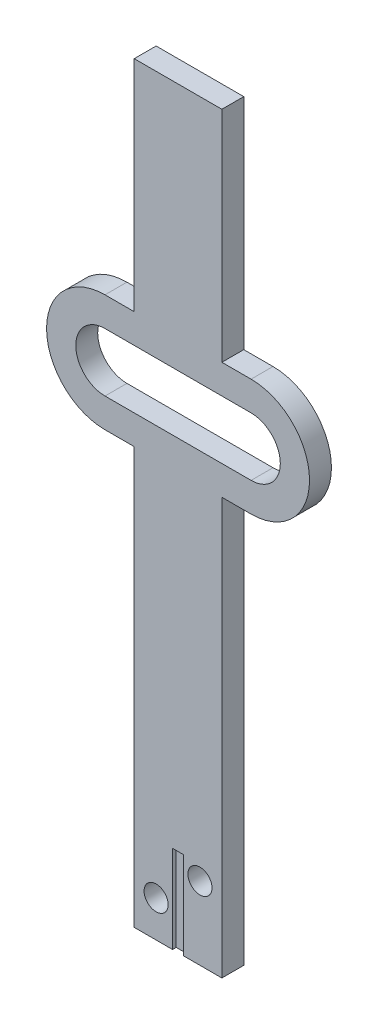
from build123d import *

# Parameters (mm, degrees)
BASE_EXTRUSION_DEPTH    = 3
ESQUISSE2_W             = 1.5
ESQUISSE2_H             = 12
ENL_V_MAT_EXTRU_1_DEPTH = 0.5
PER_AGE1_D              = 3.3
PER_AGE2_D              = 3.3


with BuildPart() as part:
    # Esquisse1 → Base-Extrusion (new body)
    with BuildSketch(Plane.XY):
        with BuildLine():
            Line((-10, 8), (-6, 8))
            Line((-6, 8), (-6, 38))
            Line((-6, 38), (6, 38))
            Line((6, 38), (6, 8))
            Line((6, 8), (10, 8))
            ThreePointArc((10, 8), (18, 0), (10, -8))
            Line((10, -8), (6, -8))
            Line((6, -8), (6, -65))
            Line((6, -65), (-6, -65))
            Line((-6, -65), (-6, -8))
            Line((-6, -8), (-10, -8))
            ThreePointArc((-10, -8), (-18, 0), (-10, 8))
        make_face()
        with BuildLine():
            Line((-10, 4), (10, 4))
            ThreePointArc((10, 4), (14, 0), (10, -4))
            Line((10, -4), (-10, -4))
            ThreePointArc((-10, -4), (-14, 0), (-10, 4))
        make_face(mode=Mode.SUBTRACT)
    extrude(amount=BASE_EXTRUSION_DEPTH)

    # Esquisse2 → Enl_v. mat.-Extru.1 (cut)
    with BuildSketch(Plane.XY.offset(3)):
        with Locations((0, -59)):
            Rectangle(ESQUISSE2_W, ESQUISSE2_H)
    extrude(amount=-ENL_V_MAT_EXTRU_1_DEPTH, mode=Mode.SUBTRACT)

    # Per_age1 (through all)
    with Locations(Plane.XY.offset(3)):
        with Locations((3, -55)):
            Hole(PER_AGE1_D / 2)

    # Per_age2 (through all)
    with Locations(Plane.XY.offset(3)):
        with Locations((-3, -60)):
            Hole(PER_AGE2_D / 2)


solid = part.part
